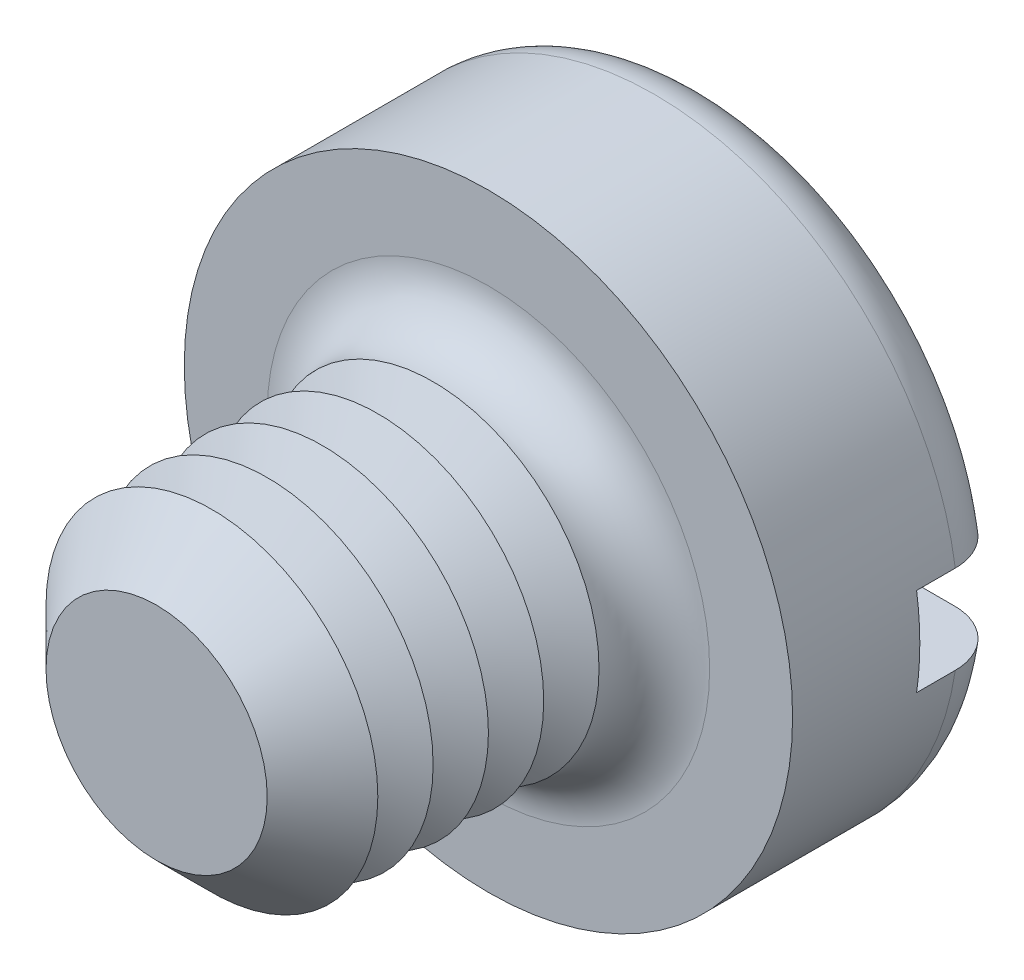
ISO-10303-21;
HEADER;
FILE_DESCRIPTION(('STEP AP214'),'2;1');
FILE_NAME('part.step','',(''),(''),'','','');
FILE_SCHEMA(('AUTOMOTIVE_DESIGN { 1 0 10303 214 1 1 1 1 }'));
ENDSEC;
DATA;
#1=APPLICATION_CONTEXT('core data for automotive mechanical design processes');
#2=APPLICATION_PROTOCOL_DEFINITION('international standard','automotive_design',2000,#1);
#3=PRODUCT_CONTEXT('',#1,'mechanical');
#4=PRODUCT('Part','Part','',(#3));
#5=PRODUCT_RELATED_PRODUCT_CATEGORY('part','',(#4));
#6=PRODUCT_DEFINITION_FORMATION('','',#4);
#7=PRODUCT_DEFINITION_CONTEXT('part definition',#1,'design');
#8=PRODUCT_DEFINITION('design','',#6,#7);
#9=PRODUCT_DEFINITION_SHAPE('','',#8);
#10=(LENGTH_UNIT() NAMED_UNIT(*) SI_UNIT(.MILLI.,.METRE.));
#11=(NAMED_UNIT(*) PLANE_ANGLE_UNIT() SI_UNIT($,.RADIAN.));
#12=(NAMED_UNIT(*) SI_UNIT($,.STERADIAN.) SOLID_ANGLE_UNIT());
#13=UNCERTAINTY_MEASURE_WITH_UNIT(LENGTH_MEASURE(1.E-05),#10,'distance_accuracy_value','');
#14=(GEOMETRIC_REPRESENTATION_CONTEXT(3) GLOBAL_UNCERTAINTY_ASSIGNED_CONTEXT((#13)) GLOBAL_UNIT_ASSIGNED_CONTEXT((#10,
#11,#12)) REPRESENTATION_CONTEXT('',''));
#15=CARTESIAN_POINT('',(0.,0.,0.));
#16=DIRECTION('',(0.,0.,1.));
#17=DIRECTION('',(1.,0.,0.));
#18=AXIS2_PLACEMENT_3D('',#15,#16,#17);
#19=CARTESIAN_POINT('',(0.,0.,-2.));
#20=DIRECTION('',(0.,0.,1.));
#21=DIRECTION('',(1.,0.,0.));
#22=AXIS2_PLACEMENT_3D('',#19,#20,#21);
#23=PLANE('',#22);
#24=CARTESIAN_POINT('',(0.,0.,-2.));
#25=DIRECTION('',(0.,0.,1.));
#26=DIRECTION('',(1.,0.,0.));
#27=AXIS2_PLACEMENT_3D('',#24,#25,#26);
#28=CIRCLE('',#27,2.25);
#29=CARTESIAN_POINT('',(-2.21415898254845,0.4,-2.));
#30=VERTEX_POINT('',#29);
#31=CARTESIAN_POINT('',(2.21415898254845,0.4,-2.));
#32=VERTEX_POINT('',#31);
#33=EDGE_CURVE('E116',#30,#32,#28,.F.);
#34=ORIENTED_EDGE('',*,*,#33,.T.);
#35=DIRECTION('',(1.,0.,0.));
#36=VECTOR('',#35,1.);
#37=CARTESIAN_POINT('',(-2.75,0.4,-2.));
#38=LINE('',#37,#36);
#39=EDGE_CURVE('E111',#30,#32,#38,.T.);
#40=ORIENTED_EDGE('',*,*,#39,.F.);
#41=EDGE_LOOP('',(#34,#40));
#42=FACE_BOUND('',#41,.T.);
#43=ADVANCED_FACE('F39',(#42),#23,.F.);
#44=CARTESIAN_POINT('',(0.,0.,-1.5));
#45=DIRECTION('',(0.,0.,1.));
#46=DIRECTION('',(1.,0.,0.));
#47=AXIS2_PLACEMENT_3D('',#44,#45,#46);
#48=TOROIDAL_SURFACE('',#47,2.25,0.5);
#49=CARTESIAN_POINT('',(-2.6296588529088,0.4,-1.78631483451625));
#50=CARTESIAN_POINT('',(-2.61332846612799,0.4,-1.80942627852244));
#51=CARTESIAN_POINT('',(-2.59501593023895,0.4,-1.83116426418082));
#52=CARTESIAN_POINT('',(-2.55497423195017,0.4,-1.87126271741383));
#53=CARTESIAN_POINT('',(-2.53324055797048,0.4,-1.88961865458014));
#54=CARTESIAN_POINT('',(-2.48702796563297,0.4,-1.92241505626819));
#55=CARTESIAN_POINT('',(-2.46255183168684,0.4,-1.93685944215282));
#56=CARTESIAN_POINT('',(-2.41154731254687,0.4,-1.96147315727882));
#57=CARTESIAN_POINT('',(-2.38501943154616,0.4,-1.97164353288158));
#58=CARTESIAN_POINT('',(-2.3303912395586,0.4,-1.98753780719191));
#59=CARTESIAN_POINT('',(-2.30227842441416,0.4,-1.99321871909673));
#60=CARTESIAN_POINT('',(-2.24549884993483,0.4,-1.99984170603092));
#61=CARTESIAN_POINT('',(-2.21683202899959,0.4,-2.00078325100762));
#62=CARTESIAN_POINT('',(-2.15939326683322,0.4,-1.99790249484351));
#63=CARTESIAN_POINT('',(-2.13062419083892,0.4,-1.99402290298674));
#64=CARTESIAN_POINT('',(-2.07413526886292,0.4,-1.98151915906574));
#65=CARTESIAN_POINT('',(-2.04641547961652,0.4,-1.97289475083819));
#66=CARTESIAN_POINT('',(-1.99264697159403,0.4,-1.95107177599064));
#67=CARTESIAN_POINT('',(-1.96660904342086,0.4,-1.93784659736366));
#68=CARTESIAN_POINT('',(-1.91713954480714,0.4,-1.90718730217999));
#69=CARTESIAN_POINT('',(-1.89370795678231,0.4,-1.88975321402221));
#70=CARTESIAN_POINT('',(-1.85029144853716,0.4,-1.85126548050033));
#71=CARTESIAN_POINT('',(-1.83028607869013,0.4,-1.83023492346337));
#72=CARTESIAN_POINT('',(-1.79417432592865,0.4,-1.78505552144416));
#73=CARTESIAN_POINT('',(-1.77806752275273,0.4,-1.76090701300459));
#74=CARTESIAN_POINT('',(-1.75056079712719,0.4,-1.71067721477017));
#75=CARTESIAN_POINT('',(-1.7390748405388,0.4,-1.68464306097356));
#76=CARTESIAN_POINT('',(-1.72075680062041,0.4,-1.63098625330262));
#77=CARTESIAN_POINT('',(-1.71392397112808,0.4,-1.60336385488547));
#78=CARTESIAN_POINT('',(-1.70525661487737,0.4,-1.54801066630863));
#79=CARTESIAN_POINT('',(-1.70330866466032,0.4,-1.52029759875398));
#80=CARTESIAN_POINT('',(-1.70414820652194,0.4,-1.46494458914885));
#81=CARTESIAN_POINT('',(-1.70693532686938,0.4,-1.43730464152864));
#82=CARTESIAN_POINT('',(-1.71709335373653,0.4,-1.38318389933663));
#83=CARTESIAN_POINT('',(-1.72441580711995,0.4,-1.35669397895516));
#84=CARTESIAN_POINT('',(-1.74335830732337,0.4,-1.30529964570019));
#85=CARTESIAN_POINT('',(-1.75497853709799,0.4,-1.2803953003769));
#86=CARTESIAN_POINT('',(-1.78229453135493,0.4,-1.23258298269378));
#87=CARTESIAN_POINT('',(-1.79803217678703,0.4,-1.20969896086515));
#88=CARTESIAN_POINT('',(-1.83304498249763,0.4,-1.16682064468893));
#89=CARTESIAN_POINT('',(-1.85232054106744,0.4,-1.1468266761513));
#90=CARTESIAN_POINT('',(-1.89433695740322,0.4,-1.10980713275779));
#91=CARTESIAN_POINT('',(-1.91714740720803,0.4,-1.09286053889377));
#92=CARTESIAN_POINT('',(-1.96524407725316,0.4,-1.06294809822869));
#93=CARTESIAN_POINT('',(-1.99053056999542,0.4,-1.04998269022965));
#94=CARTESIAN_POINT('',(-2.04340612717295,0.4,-1.02814800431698));
#95=CARTESIAN_POINT('',(-2.07103098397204,0.4,-1.01936532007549));
#96=CARTESIAN_POINT('',(-2.12735840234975,0.4,-1.00652373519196));
#97=CARTESIAN_POINT('',(-2.15606102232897,0.4,-1.00246509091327));
#98=CARTESIAN_POINT('',(-2.21395379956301,0.4,-0.999181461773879));
#99=CARTESIAN_POINT('',(-2.24314598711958,0.4,-0.999992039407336));
#100=CARTESIAN_POINT('',(-2.30097585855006,0.4,-1.00652779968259));
#101=CARTESIAN_POINT('',(-2.32961355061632,0.4,-1.01225290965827));
#102=CARTESIAN_POINT('',(-2.38536238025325,0.4,-1.02843951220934));
#103=CARTESIAN_POINT('',(-2.41248047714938,0.4,-1.03887701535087));
#104=CARTESIAN_POINT('',(-2.46454860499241,0.4,-1.06421009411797));
#105=CARTESIAN_POINT('',(-2.48949875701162,0.4,-1.0791054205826));
#106=CARTESIAN_POINT('',(-2.53620471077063,0.4,-1.11274531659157));
#107=CARTESIAN_POINT('',(-2.55799482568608,0.4,-1.1314422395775));
#108=CARTESIAN_POINT('',(-2.59807595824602,0.4,-1.17227176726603));
#109=CARTESIAN_POINT('',(-2.6163672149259,0.4,-1.19440413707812));
#110=CARTESIAN_POINT('',(-2.64868581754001,0.4,-1.24117072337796));
#111=CARTESIAN_POINT('',(-2.66276466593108,0.4,-1.26576935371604));
#112=CARTESIAN_POINT('',(-2.68654482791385,0.4,-1.31699754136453));
#113=CARTESIAN_POINT('',(-2.69624657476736,0.4,-1.34362689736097));
#114=CARTESIAN_POINT('',(-2.71090527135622,0.4,-1.39787706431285));
#115=CARTESIAN_POINT('',(-2.71590826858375,0.4,-1.4254854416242));
#116=CARTESIAN_POINT('',(-2.72118463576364,0.4,-1.48115803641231));
#117=CARTESIAN_POINT('',(-2.72145696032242,0.4,-1.50922235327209));
#118=CARTESIAN_POINT('',(-2.71727180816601,0.4,-1.56487271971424));
#119=CARTESIAN_POINT('',(-2.71283440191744,0.4,-1.59246029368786));
#120=CARTESIAN_POINT('',(-2.69939521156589,0.4,-1.64647499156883));
#121=CARTESIAN_POINT('',(-2.69039909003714,0.4,-1.67290351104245));
#122=CARTESIAN_POINT('',(-2.67251693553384,0.4,-1.71382731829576));
#123=CARTESIAN_POINT('',(-2.66497994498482,0.4,-1.72892686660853));
#124=CARTESIAN_POINT('',(-2.64841616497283,0.4,-1.75828509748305));
#125=CARTESIAN_POINT('',(-2.63938938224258,0.4,-1.77254378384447));
#126=CARTESIAN_POINT('',(-2.6296588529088,0.4,-1.78631483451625));
#127=B_SPLINE_CURVE_WITH_KNOTS('',3,(#49,#50,#51,#52,#53,#54,#55,#56,#57,#58,#59,#60,#61,#62,
#63,#64,#65,#66,#67,#68,#69,#70,#71,#72,#73,#74,#75,#76,#77,#78,#79,#80,#81,#82,#83,#84,#85,#86,
#87,#88,#89,#90,#91,#92,#93,#94,#95,#96,#97,#98,#99,#100,#101,#102,#103,#104,#105,#106,#107,
#108,#109,#110,#111,#112,#113,#114,#115,#116,#117,#118,#119,#120,#121,#122,#123,#124,#125,#126),
.UNSPECIFIED.,.T.,.F.,(4,2,2,2,2,2,2,2,2,2,2,2,2,2,2,2,2,2,2,2,2,2,2,2,2,2,2,2,2,2,2,2,2,2,2,2,
2,2,4),(0.,0.0848338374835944,0.16978050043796,0.25464168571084,0.339482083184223,
0.425125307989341,0.510778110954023,0.597458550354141,0.684143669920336,0.771338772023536,
0.85853328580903,0.945187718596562,1.03183280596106,1.11678035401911,1.20171427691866,
1.28465703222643,1.36759327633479,1.4496584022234,1.53172702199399,1.61466526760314,
1.69761285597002,1.78247103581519,1.86733856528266,1.95389396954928,2.0404540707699,
2.12764713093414,2.21483890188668,2.30159172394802,2.38833969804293,2.4740609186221,
2.55977628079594,2.6443962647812,2.72900787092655,2.81278135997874,2.89657336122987,
2.98000971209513,3.06334267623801,3.113891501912,3.16444009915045),.UNSPECIFIED.);
#128=CARTESIAN_POINT('',(-2.72075357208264,0.4,-1.50000000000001));
#129=VERTEX_POINT('',#128);
#130=EDGE_CURVE('E210',#129,#30,#127,.T.);
#131=ORIENTED_EDGE('',*,*,#130,.F.);
#132=CARTESIAN_POINT('',(0.,0.,-1.5));
#133=DIRECTION('',(0.,0.,1.));
#134=DIRECTION('',(1.,0.,0.));
#135=AXIS2_PLACEMENT_3D('',#132,#133,#134);
#136=CIRCLE('',#135,2.75);
#137=CARTESIAN_POINT('',(2.7207535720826,0.4,-1.5));
#138=VERTEX_POINT('',#137);
#139=EDGE_CURVE('E125',#138,#129,#136,.T.);
#140=ORIENTED_EDGE('',*,*,#139,.F.);
#141=CARTESIAN_POINT('',(1.7362507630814,0.4,-1.6752840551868));
#142=CARTESIAN_POINT('',(1.74636083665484,0.4,-1.70159961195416));
#143=CARTESIAN_POINT('',(1.7587429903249,0.4,-1.72706707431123));
#144=CARTESIAN_POINT('',(1.78764414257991,0.4,-1.77556609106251));
#145=CARTESIAN_POINT('',(1.80416918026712,0.4,-1.79859401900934));
#146=CARTESIAN_POINT('',(1.84080454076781,0.4,-1.84153587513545));
#147=CARTESIAN_POINT('',(1.86090949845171,0.4,-1.86145438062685));
#148=CARTESIAN_POINT('',(1.9041208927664,0.4,-1.89769607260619));
#149=CARTESIAN_POINT('',(1.92722659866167,0.4,-1.91402013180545));
#150=CARTESIAN_POINT('',(1.97620958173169,0.4,-1.94291288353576));
#151=CARTESIAN_POINT('',(2.00212726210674,0.4,-1.95541309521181));
#152=CARTESIAN_POINT('',(2.05567603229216,0.4,-1.97595143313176));
#153=CARTESIAN_POINT('',(2.08330733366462,0.4,-1.98398900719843));
#154=CARTESIAN_POINT('',(2.13989163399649,0.4,-1.99545904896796));
#155=CARTESIAN_POINT('',(2.16885726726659,0.4,-1.99882930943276));
#156=CARTESIAN_POINT('',(2.22694412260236,0.4,-2.00065872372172));
#157=CARTESIAN_POINT('',(2.25606534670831,0.4,-1.99911781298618));
#158=CARTESIAN_POINT('',(2.31362436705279,0.4,-1.99114818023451));
#159=CARTESIAN_POINT('',(2.34206235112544,0.4,-1.98472081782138));
#160=CARTESIAN_POINT('',(2.39743709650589,0.4,-1.96713601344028));
#161=CARTESIAN_POINT('',(2.42437392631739,0.4,-1.95597878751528));
#162=CARTESIAN_POINT('',(2.47569769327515,0.4,-1.92935960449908));
#163=CARTESIAN_POINT('',(2.50010686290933,0.4,-1.91394052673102));
#164=CARTESIAN_POINT('',(2.54594525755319,0.4,-1.8791725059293));
#165=CARTESIAN_POINT('',(2.56737468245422,0.4,-1.85982382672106));
#166=CARTESIAN_POINT('',(2.60634898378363,0.4,-1.81801641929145));
#167=CARTESIAN_POINT('',(2.6239407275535,0.4,-1.79560138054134));
#168=CARTESIAN_POINT('',(2.65505953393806,0.4,-1.7481077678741));
#169=CARTESIAN_POINT('',(2.66858686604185,0.4,-1.72302937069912));
#170=CARTESIAN_POINT('',(2.69103536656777,0.4,-1.67123055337));
#171=CARTESIAN_POINT('',(2.70000740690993,0.4,-1.64453217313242));
#172=CARTESIAN_POINT('',(2.71330608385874,0.4,-1.59000262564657));
#173=CARTESIAN_POINT('',(2.71763293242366,0.4,-1.5621715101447));
#174=CARTESIAN_POINT('',(2.72149675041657,0.4,-1.50637655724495));
#175=CARTESIAN_POINT('',(2.72106725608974,0.4,-1.47841503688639));
#176=CARTESIAN_POINT('',(2.7155123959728,0.4,-1.42296287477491));
#177=CARTESIAN_POINT('',(2.71038711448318,0.4,-1.39547222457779));
#178=CARTESIAN_POINT('',(2.69560462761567,0.4,-1.34178071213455));
#179=CARTESIAN_POINT('',(2.68595389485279,0.4,-1.31557806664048));
#180=CARTESIAN_POINT('',(2.66240876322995,0.4,-1.26515516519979));
#181=CARTESIAN_POINT('',(2.64851431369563,0.4,-1.24093493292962));
#182=CARTESIAN_POINT('',(2.61681930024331,0.4,-1.19504594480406));
#183=CARTESIAN_POINT('',(2.59900198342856,0.4,-1.17338876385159));
#184=CARTESIAN_POINT('',(2.56001495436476,0.4,-1.13333899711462));
#185=CARTESIAN_POINT('',(2.53884510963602,0.4,-1.11494654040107));
#186=CARTESIAN_POINT('',(2.49354554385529,0.4,-1.08175888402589));
#187=CARTESIAN_POINT('',(2.46938991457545,0.4,-1.06699905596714));
#188=CARTESIAN_POINT('',(2.41896725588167,0.4,-1.04168682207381));
#189=CARTESIAN_POINT('',(2.39270009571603,0.4,-1.03113467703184));
#190=CARTESIAN_POINT('',(2.33844927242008,0.4,-1.01439607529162));
#191=CARTESIAN_POINT('',(2.31044823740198,0.4,-1.00826592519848));
#192=CARTESIAN_POINT('',(2.2538175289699,0.4,-1.00073183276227));
#193=CARTESIAN_POINT('',(2.22518781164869,0.4,-0.999328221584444));
#194=CARTESIAN_POINT('',(2.16774231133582,0.4,-1.00127811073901));
#195=CARTESIAN_POINT('',(2.13892848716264,0.4,-1.00468955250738));
#196=CARTESIAN_POINT('',(2.08227193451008,0.4,-1.01626887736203));
#197=CARTESIAN_POINT('',(2.05442926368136,0.4,-1.02443704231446));
#198=CARTESIAN_POINT('',(2.00032604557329,0.4,-1.04537295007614));
#199=CARTESIAN_POINT('',(1.97407661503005,0.4,-1.05816944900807));
#200=CARTESIAN_POINT('',(1.92411255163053,0.4,-1.08801035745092));
#201=CARTESIAN_POINT('',(1.90039792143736,0.4,-1.10505477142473));
#202=CARTESIAN_POINT('',(1.85633574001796,0.4,-1.14282887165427));
#203=CARTESIAN_POINT('',(1.83597040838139,0.4,-1.16353779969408));
#204=CARTESIAN_POINT('',(1.79908731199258,0.4,-1.20813793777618));
#205=CARTESIAN_POINT('',(1.78256899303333,0.4,-1.23202868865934));
#206=CARTESIAN_POINT('',(1.75420022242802,0.4,-1.28183173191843));
#207=CARTESIAN_POINT('',(1.74226635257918,0.4,-1.30769648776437));
#208=CARTESIAN_POINT('',(1.72302798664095,0.4,-1.36110211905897));
#209=CARTESIAN_POINT('',(1.71572395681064,0.4,-1.38864316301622));
#210=CARTESIAN_POINT('',(1.70611974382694,0.4,-1.44392326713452));
#211=CARTESIAN_POINT('',(1.70370764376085,0.4,-1.47164298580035));
#212=CARTESIAN_POINT('',(1.70363822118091,0.4,-1.52706336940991));
#213=CARTESIAN_POINT('',(1.70597448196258,0.4,-1.55476400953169));
#214=CARTESIAN_POINT('',(1.71335146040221,0.4,-1.59796127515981));
#215=CARTESIAN_POINT('',(1.71686033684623,0.4,-1.61373520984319));
#216=CARTESIAN_POINT('',(1.7254146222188,0.4,-1.64486018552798));
#217=CARTESIAN_POINT('',(1.73045999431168,0.4,-1.66021123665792));
#218=CARTESIAN_POINT('',(1.7362507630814,0.4,-1.6752840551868));
#219=B_SPLINE_CURVE_WITH_KNOTS('',3,(#141,#142,#143,#144,#145,#146,#147,#148,#149,#150,#151,
#152,#153,#154,#155,#156,#157,#158,#159,#160,#161,#162,#163,#164,#165,#166,#167,#168,#169,#170,
#171,#172,#173,#174,#175,#176,#177,#178,#179,#180,#181,#182,#183,#184,#185,#186,#187,#188,#189,
#190,#191,#192,#193,#194,#195,#196,#197,#198,#199,#200,#201,#202,#203,#204,#205,#206,#207,#208,
#209,#210,#211,#212,#213,#214,#215,#216,#217,#218),.UNSPECIFIED.,.T.,.F.,(4,2,2,2,2,2,2,2,2,2,2,
2,2,2,2,2,2,2,2,2,2,2,2,2,2,2,2,2,2,2,2,2,2,2,2,2,2,2,4),(0.,0.0845117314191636,
0.169147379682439,0.253657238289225,0.338146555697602,0.424070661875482,0.510005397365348,
0.597074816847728,0.684145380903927,0.771191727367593,0.858234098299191,0.944430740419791,
1.03062159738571,1.11569223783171,1.20075723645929,1.28485012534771,1.36893917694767,
1.45243570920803,1.53593074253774,1.61930671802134,1.70268368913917,1.7864238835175,
1.87016738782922,1.95469664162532,2.03923113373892,2.12482389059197,2.21042264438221,
2.29706026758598,2.38370302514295,2.47089361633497,2.55808429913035,2.64479602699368,
2.73149525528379,2.81653234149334,2.9015779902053,2.98465497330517,3.06761976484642,
3.11602689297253,3.164432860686),.UNSPECIFIED.);
#220=EDGE_CURVE('E212',#32,#138,#219,.T.);
#221=ORIENTED_EDGE('',*,*,#220,.F.);
#222=ORIENTED_EDGE('',*,*,#33,.F.);
#223=EDGE_LOOP('',(#131,#140,#221,#222));
#224=FACE_BOUND('',#223,.T.);
#225=ADVANCED_FACE('F194',(#224),#48,.T.);
#226=CARTESIAN_POINT('',(0.,0.,-2.));
#227=DIRECTION('',(0.,0.,1.));
#228=DIRECTION('',(1.,0.,0.));
#229=AXIS2_PLACEMENT_3D('',#226,#227,#228);
#230=CYLINDRICAL_SURFACE('',#229,2.75);
#231=DIRECTION('',(0.,0.,1.));
#232=VECTOR('',#231,1.);
#233=CARTESIAN_POINT('',(2.72075357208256,0.4,-2.));
#234=LINE('',#233,#232);
#235=CARTESIAN_POINT('',(2.72075357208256,0.4,-1.15));
#236=VERTEX_POINT('',#235);
#237=EDGE_CURVE('E224',#138,#236,#234,.T.);
#238=ORIENTED_EDGE('',*,*,#237,.F.);
#239=ORIENTED_EDGE('',*,*,#139,.T.);
#240=DIRECTION('',(0.,0.,1.));
#241=VECTOR('',#240,1.);
#242=CARTESIAN_POINT('',(-2.72075357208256,0.4,-2.));
#243=LINE('',#242,#241);
#244=CARTESIAN_POINT('',(-2.72075357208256,0.4,-1.15));
#245=VERTEX_POINT('',#244);
#246=EDGE_CURVE('E63',#245,#129,#243,.F.);
#247=ORIENTED_EDGE('',*,*,#246,.F.);
#248=CARTESIAN_POINT('',(0.,0.,-1.15));
#249=DIRECTION('',(0.,0.,-1.));
#250=DIRECTION('',(-1.,0.,0.));
#251=AXIS2_PLACEMENT_3D('',#248,#249,#250);
#252=CIRCLE('',#251,2.75);
#253=CARTESIAN_POINT('',(-2.72075357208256,-0.4,-1.15));
#254=VERTEX_POINT('',#253);
#255=EDGE_CURVE('E43',#245,#254,#252,.F.);
#256=ORIENTED_EDGE('',*,*,#255,.T.);
#257=DIRECTION('',(0.,0.,1.));
#258=VECTOR('',#257,1.);
#259=CARTESIAN_POINT('',(-2.72075357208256,-0.4,-2.));
#260=LINE('',#259,#258);
#261=CARTESIAN_POINT('',(-2.72075357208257,-0.4,-1.5));
#262=VERTEX_POINT('',#261);
#263=EDGE_CURVE('E221',#262,#254,#260,.T.);
#264=ORIENTED_EDGE('',*,*,#263,.F.);
#265=CARTESIAN_POINT('',(2.72075357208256,-0.4,-1.5));
#266=VERTEX_POINT('',#265);
#267=EDGE_CURVE('E127',#262,#266,#136,.T.);
#268=ORIENTED_EDGE('',*,*,#267,.T.);
#269=DIRECTION('',(0.,0.,1.));
#270=VECTOR('',#269,1.);
#271=CARTESIAN_POINT('',(2.72075357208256,-0.4,-2.));
#272=LINE('',#271,#270);
#273=CARTESIAN_POINT('',(2.72075357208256,-0.4,-1.15));
#274=VERTEX_POINT('',#273);
#275=EDGE_CURVE('E55',#274,#266,#272,.F.);
#276=ORIENTED_EDGE('',*,*,#275,.F.);
#277=EDGE_CURVE('E11',#274,#236,#252,.F.);
#278=ORIENTED_EDGE('',*,*,#277,.T.);
#279=EDGE_LOOP('',(#238,#239,#247,#256,#264,#268,#276,#278));
#280=FACE_BOUND('',#279,.T.);
#281=CARTESIAN_POINT('',(0.,0.,0.));
#282=DIRECTION('',(0.,0.,1.));
#283=DIRECTION('',(1.,0.,0.));
#284=AXIS2_PLACEMENT_3D('',#281,#282,#283);
#285=CIRCLE('',#284,2.75);
#286=CARTESIAN_POINT('',(2.75,0.,0.));
#287=VERTEX_POINT('',#286);
#288=EDGE_CURVE('E227',#287,#287,#285,.T.);
#289=ORIENTED_EDGE('',*,*,#288,.F.);
#290=EDGE_LOOP('',(#289));
#291=FACE_BOUND('',#290,.T.);
#292=ADVANCED_FACE('F190',(#280,#291),#230,.T.);
#293=CARTESIAN_POINT('',(2.21415898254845,-0.4,-2.));
#294=VERTEX_POINT('',#293);
#295=CARTESIAN_POINT('',(-2.21415898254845,-0.4,-2.));
#296=VERTEX_POINT('',#295);
#297=EDGE_CURVE('E109',#294,#296,#28,.F.);
#298=ORIENTED_EDGE('',*,*,#297,.T.);
#299=DIRECTION('',(-1.,0.,0.));
#300=VECTOR('',#299,1.);
#301=CARTESIAN_POINT('',(-2.75,-0.4,-2.));
#302=LINE('',#301,#300);
#303=EDGE_CURVE('E96',#294,#296,#302,.T.);
#304=ORIENTED_EDGE('',*,*,#303,.F.);
#305=EDGE_LOOP('',(#298,#304));
#306=FACE_BOUND('',#305,.T.);
#307=ADVANCED_FACE('F108',(#306),#23,.F.);
#308=CARTESIAN_POINT('',(0.,0.,0.));
#309=DIRECTION('',(0.,0.,1.));
#310=DIRECTION('',(1.,0.,0.));
#311=AXIS2_PLACEMENT_3D('',#308,#309,#310);
#312=PLANE('',#311);
#313=CARTESIAN_POINT('',(0.,0.,0.));
#314=DIRECTION('',(0.,0.,1.));
#315=DIRECTION('',(1.,0.,0.));
#316=AXIS2_PLACEMENT_3D('',#313,#314,#315);
#317=CIRCLE('',#316,2.);
#318=CARTESIAN_POINT('',(2.,0.,0.));
#319=VERTEX_POINT('',#318);
#320=EDGE_CURVE('E115',#319,#319,#317,.F.);
#321=ORIENTED_EDGE('',*,*,#320,.T.);
#322=EDGE_LOOP('',(#321));
#323=FACE_BOUND('',#322,.T.);
#324=ORIENTED_EDGE('',*,*,#288,.T.);
#325=EDGE_LOOP('',(#324));
#326=FACE_BOUND('',#325,.T.);
#327=ADVANCED_FACE('F189',(#323,#326),#312,.T.);
#328=CARTESIAN_POINT('',(-2.6296588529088,-0.4,-1.78631483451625));
#329=CARTESIAN_POINT('',(-2.64575286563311,-0.4,-1.76353353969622));
#330=CARTESIAN_POINT('',(-2.65994473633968,-0.4,-1.73938506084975));
#331=CARTESIAN_POINT('',(-2.68408879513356,-0.4,-1.68903091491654));
#332=CARTESIAN_POINT('',(-2.69403633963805,-0.4,-1.6628230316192));
#333=CARTESIAN_POINT('',(-2.70937899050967,-0.4,-1.60911025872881));
#334=CARTESIAN_POINT('',(-2.71477511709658,-0.4,-1.5816056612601));
#335=CARTESIAN_POINT('',(-2.72085365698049,-0.4,-1.52608718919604));
#336=CARTESIAN_POINT('',(-2.7215371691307,-0.4,-1.49807343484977));
#337=CARTESIAN_POINT('',(-2.71817903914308,-0.4,-1.44242333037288));
#338=CARTESIAN_POINT('',(-2.71415291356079,-0.4,-1.41478604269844));
#339=CARTESIAN_POINT('',(-2.70152104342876,-0.4,-1.36057835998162));
#340=CARTESIAN_POINT('',(-2.69291517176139,-0.4,-1.33400799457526));
#341=CARTESIAN_POINT('',(-2.67137052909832,-0.4,-1.28266198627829));
#342=CARTESIAN_POINT('',(-2.65842829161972,-0.4,-1.25788779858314));
#343=CARTESIAN_POINT('',(-2.62859348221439,-0.4,-1.21084577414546));
#344=CARTESIAN_POINT('',(-2.61170082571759,-0.4,-1.18857799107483));
#345=CARTESIAN_POINT('',(-2.5743351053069,-0.4,-1.1470221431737));
#346=CARTESIAN_POINT('',(-2.55383974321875,-0.4,-1.12775413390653));
#347=CARTESIAN_POINT('',(-2.5099353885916,-0.4,-1.09288845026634));
#348=CARTESIAN_POINT('',(-2.48652625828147,-0.4,-1.07729094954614));
#349=CARTESIAN_POINT('',(-2.43718903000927,-0.4,-1.0500239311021));
#350=CARTESIAN_POINT('',(-2.41123629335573,-0.4,-1.0383990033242));
#351=CARTESIAN_POINT('',(-2.35776417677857,-0.4,-1.01960886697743));
#352=CARTESIAN_POINT('',(-2.33024469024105,-0.4,-1.01244396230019));
#353=CARTESIAN_POINT('',(-2.27404134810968,-0.4,-1.00268156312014));
#354=CARTESIAN_POINT('',(-2.24534705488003,-0.4,-1.00014414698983));
#355=CARTESIAN_POINT('',(-2.18793513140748,-0.4,-0.999867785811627));
#356=CARTESIAN_POINT('',(-2.15921749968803,-0.4,-1.00212917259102));
#357=CARTESIAN_POINT('',(-2.10225052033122,-0.4,-1.01142552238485));
#358=CARTESIAN_POINT('',(-2.07400941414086,-0.4,-1.01851105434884));
#359=CARTESIAN_POINT('',(-2.01911044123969,-0.4,-1.03730994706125));
#360=CARTESIAN_POINT('',(-1.99245264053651,-0.4,-1.04902350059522));
#361=CARTESIAN_POINT('',(-1.94142108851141,-0.4,-1.07679847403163));
#362=CARTESIAN_POINT('',(-1.91705303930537,-0.4,-1.09287038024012));
#363=CARTESIAN_POINT('',(-1.87139758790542,-0.4,-1.12891897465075));
#364=CARTESIAN_POINT('',(-1.85011007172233,-0.4,-1.148895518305));
#365=CARTESIAN_POINT('',(-1.81149058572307,-0.4,-1.19196940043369));
#366=CARTESIAN_POINT('',(-1.79411779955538,-0.4,-1.21503011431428));
#367=CARTESIAN_POINT('',(-1.76359546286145,-0.4,-1.26379588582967));
#368=CARTESIAN_POINT('',(-1.75044532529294,-0.4,-1.28950057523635));
#369=CARTESIAN_POINT('',(-1.72906221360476,-0.4,-1.3422057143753));
#370=CARTESIAN_POINT('',(-1.72072512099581,-0.4,-1.3691639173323));
#371=CARTESIAN_POINT('',(-1.70880448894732,-0.4,-1.42411084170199));
#372=CARTESIAN_POINT('',(-1.7052202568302,-0.4,-1.45209941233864));
#373=CARTESIAN_POINT('',(-1.70295553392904,-0.4,-1.50768522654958));
#374=CARTESIAN_POINT('',(-1.70417398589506,-0.4,-1.53527840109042));
#375=CARTESIAN_POINT('',(-1.71124536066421,-0.4,-1.58986292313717));
#376=CARTESIAN_POINT('',(-1.71709811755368,-0.4,-1.61685429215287));
#377=CARTESIAN_POINT('',(-1.73321132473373,-0.4,-1.66938107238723));
#378=CARTESIAN_POINT('',(-1.74345625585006,-0.4,-1.69492125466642));
#379=CARTESIAN_POINT('',(-1.76802111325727,-0.4,-1.74395877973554));
#380=CARTESIAN_POINT('',(-1.78234133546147,-0.4,-1.76745597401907));
#381=CARTESIAN_POINT('',(-1.81488631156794,-0.4,-1.81216193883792));
#382=CARTESIAN_POINT('',(-1.83317116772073,-0.4,-1.83332693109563));
#383=CARTESIAN_POINT('',(-1.87296030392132,-0.4,-1.872375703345));
#384=CARTESIAN_POINT('',(-1.89446497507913,-0.4,-1.89025908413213));
#385=CARTESIAN_POINT('',(-1.94063077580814,-0.4,-1.92267732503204));
#386=CARTESIAN_POINT('',(-1.96535444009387,-0.4,-1.93712316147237));
#387=CARTESIAN_POINT('',(-2.01684705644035,-0.4,-1.96173690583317));
#388=CARTESIAN_POINT('',(-2.04361620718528,-0.4,-1.97190439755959));
#389=CARTESIAN_POINT('',(-2.09891021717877,-0.4,-1.9878230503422));
#390=CARTESIAN_POINT('',(-2.12745653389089,-0.4,-1.99349978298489));
#391=CARTESIAN_POINT('',(-2.18509639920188,-0.4,-1.99999556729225));
#392=CARTESIAN_POINT('',(-2.21418994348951,-0.4,-2.00081465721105));
#393=CARTESIAN_POINT('',(-2.27218032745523,-0.4,-1.99755156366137));
#394=CARTESIAN_POINT('',(-2.30107643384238,-0.4,-1.99345627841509));
#395=CARTESIAN_POINT('',(-2.35776697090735,-0.4,-1.98043125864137));
#396=CARTESIAN_POINT('',(-2.38556116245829,-0.4,-1.97150048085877));
#397=CARTESIAN_POINT('',(-2.43901832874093,-0.4,-1.94912081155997));
#398=CARTESIAN_POINT('',(-2.46469578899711,-0.4,-1.93570648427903));
#399=CARTESIAN_POINT('',(-2.51337022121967,-0.4,-1.90471183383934));
#400=CARTESIAN_POINT('',(-2.53637056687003,-0.4,-1.88713684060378));
#401=CARTESIAN_POINT('',(-2.57111030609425,-0.4,-1.85552084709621));
#402=CARTESIAN_POINT('',(-2.58386709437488,-0.4,-1.84257896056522));
#403=CARTESIAN_POINT('',(-2.60790410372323,-0.4,-1.81538935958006));
#404=CARTESIAN_POINT('',(-2.61918433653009,-0.4,-1.80114165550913));
#405=CARTESIAN_POINT('',(-2.6296588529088,-0.4,-1.78631483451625));
#406=B_SPLINE_CURVE_WITH_KNOTS('',3,(#328,#329,#330,#331,#332,#333,#334,#335,#336,#337,#338,
#339,#340,#341,#342,#343,#344,#345,#346,#347,#348,#349,#350,#351,#352,#353,#354,#355,#356,#357,
#358,#359,#360,#361,#362,#363,#364,#365,#366,#367,#368,#369,#370,#371,#372,#373,#374,#375,#376,
#377,#378,#379,#380,#381,#382,#383,#384,#385,#386,#387,#388,#389,#390,#391,#392,#393,#394,#395,
#396,#397,#398,#399,#400,#401,#402,#403,#404,#405),.UNSPECIFIED.,.T.,.F.,(4,2,2,2,2,2,2,2,2,2,2,
2,2,2,2,2,2,2,2,2,2,2,2,2,2,2,2,2,2,2,2,2,2,2,2,2,2,2,4),(0.,0.0836125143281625,
0.167316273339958,0.251001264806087,0.334666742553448,0.418057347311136,0.501450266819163,
0.584910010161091,0.668371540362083,0.752369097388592,0.836370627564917,0.921286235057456,
1.00620762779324,1.09222390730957,1.17824613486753,1.26518425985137,1.35212600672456,
1.43927882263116,1.52642841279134,1.61262232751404,1.69880425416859,1.7830443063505,
1.86727208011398,1.9497371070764,2.03219918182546,2.1143722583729,2.19655130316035,
2.28007615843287,2.36361116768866,2.44911836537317,2.53463387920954,2.62153862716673,
2.70844269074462,2.79557895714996,2.88273403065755,2.96923214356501,3.05562004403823,
3.11003826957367,3.16445606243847),.UNSPECIFIED.);
#407=EDGE_CURVE('E103',#296,#262,#406,.T.);
#408=ORIENTED_EDGE('',*,*,#407,.F.);
#409=ORIENTED_EDGE('',*,*,#297,.F.);
#410=CARTESIAN_POINT('',(1.7362507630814,-0.4,-1.6752840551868));
#411=CARTESIAN_POINT('',(1.72641416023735,-0.4,-1.64967314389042));
#412=CARTESIAN_POINT('',(1.71871480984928,-0.4,-1.62322216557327));
#413=CARTESIAN_POINT('',(1.70786038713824,-0.4,-1.56938399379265));
#414=CARTESIAN_POINT('',(1.70470970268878,-0.4,-1.54199592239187));
#415=CARTESIAN_POINT('',(1.70306971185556,-0.4,-1.48708393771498));
#416=CARTESIAN_POINT('',(1.70457942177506,-0.4,-1.45956005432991));
#417=CARTESIAN_POINT('',(1.71220670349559,-0.4,-1.40516538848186));
#418=CARTESIAN_POINT('',(1.71832341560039,-0.4,-1.3782944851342));
#419=CARTESIAN_POINT('',(1.73494792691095,-0.4,-1.32598312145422));
#420=CARTESIAN_POINT('',(1.74545076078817,-0.4,-1.30054108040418));
#421=CARTESIAN_POINT('',(1.77051013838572,-0.4,-1.25173932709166));
#422=CARTESIAN_POINT('',(1.7850670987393,-0.4,-1.22837982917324));
#423=CARTESIAN_POINT('',(1.81806903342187,-0.4,-1.1839775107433));
#424=CARTESIAN_POINT('',(1.8365752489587,-0.4,-1.16298023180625));
#425=CARTESIAN_POINT('',(1.87677669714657,-0.4,-1.1243010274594));
#426=CARTESIAN_POINT('',(1.89847230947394,-0.4,-1.10661949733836));
#427=CARTESIAN_POINT('',(1.94498854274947,-0.4,-1.07463966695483));
#428=CARTESIAN_POINT('',(1.96987078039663,-0.4,-1.06043095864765));
#429=CARTESIAN_POINT('',(2.02163980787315,-0.4,-1.0363161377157));
#430=CARTESIAN_POINT('',(2.04852678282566,-0.4,-1.02641042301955));
#431=CARTESIAN_POINT('',(2.10400319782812,-0.4,-1.01104128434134));
#432=CARTESIAN_POINT('',(2.13261287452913,-0.4,-1.00565079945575));
#433=CARTESIAN_POINT('',(2.19033179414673,-0.4,-0.999735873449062));
#434=CARTESIAN_POINT('',(2.2194410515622,-0.4,-0.999211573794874));
#435=CARTESIAN_POINT('',(2.27740442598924,-0.4,-1.00306591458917));
#436=CARTESIAN_POINT('',(2.30625777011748,-0.4,-1.00745623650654));
#437=CARTESIAN_POINT('',(2.36280530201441,-0.4,-1.02105937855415));
#438=CARTESIAN_POINT('',(2.39049952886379,-0.4,-1.03027203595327));
#439=CARTESIAN_POINT('',(2.44369359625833,-0.4,-1.05318710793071));
#440=CARTESIAN_POINT('',(2.46920965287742,-0.4,-1.0668518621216));
#441=CARTESIAN_POINT('',(2.51754507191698,-0.4,-1.09832423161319));
#442=CARTESIAN_POINT('',(2.54036461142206,-0.4,-1.11613157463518));
#443=CARTESIAN_POINT('',(2.58234752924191,-0.4,-1.15513986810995));
#444=CARTESIAN_POINT('',(2.601553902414,-0.4,-1.1762945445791));
#445=CARTESIAN_POINT('',(2.63609001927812,-0.4,-1.22156192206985));
#446=CARTESIAN_POINT('',(2.65142002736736,-0.4,-1.24567442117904));
#447=CARTESIAN_POINT('',(2.67757733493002,-0.4,-1.29585881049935));
#448=CARTESIAN_POINT('',(2.68845668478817,-0.4,-1.32190357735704));
#449=CARTESIAN_POINT('',(2.7056478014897,-0.4,-1.375459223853));
#450=CARTESIAN_POINT('',(2.71195980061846,-0.4,-1.40297002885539));
#451=CARTESIAN_POINT('',(2.71979288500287,-0.4,-1.45843707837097));
#452=CARTESIAN_POINT('',(2.72135241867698,-0.4,-1.48638789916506));
#453=CARTESIAN_POINT('',(2.71974298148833,-0.4,-1.54215266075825));
#454=CARTESIAN_POINT('',(2.71657412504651,-0.4,-1.56996660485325));
#455=CARTESIAN_POINT('',(2.70561779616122,-0.4,-1.62459191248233));
#456=CARTESIAN_POINT('',(2.69784258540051,-0.4,-1.65140573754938));
#457=CARTESIAN_POINT('',(2.6779146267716,-0.4,-1.70335337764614));
#458=CARTESIAN_POINT('',(2.66576185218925,-0.4,-1.72848718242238));
#459=CARTESIAN_POINT('',(2.63739107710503,-0.4,-1.77645196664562));
#460=CARTESIAN_POINT('',(2.62116029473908,-0.4,-1.79927538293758));
#461=CARTESIAN_POINT('',(2.58512700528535,-0.4,-1.84190182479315));
#462=CARTESIAN_POINT('',(2.56532438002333,-0.4,-1.86170475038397));
#463=CARTESIAN_POINT('',(2.522535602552,-0.4,-1.89791219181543));
#464=CARTESIAN_POINT('',(2.49952399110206,-0.4,-1.91428661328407));
#465=CARTESIAN_POINT('',(2.45110500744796,-0.4,-1.94299324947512));
#466=CARTESIAN_POINT('',(2.4256974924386,-0.4,-1.95532522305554));
#467=CARTESIAN_POINT('',(2.37288090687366,-0.4,-1.97575769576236));
#468=CARTESIAN_POINT('',(2.34545135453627,-0.4,-1.98380524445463));
#469=CARTESIAN_POINT('',(2.28963821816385,-0.4,-1.99524443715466));
#470=CARTESIAN_POINT('',(2.26125456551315,-0.4,-1.99863574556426));
#471=CARTESIAN_POINT('',(2.20395671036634,-0.4,-2.00070487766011));
#472=CARTESIAN_POINT('',(2.17504033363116,-0.4,-1.99932265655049));
#473=CARTESIAN_POINT('',(2.11784130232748,-0.4,-1.9917648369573));
#474=CARTESIAN_POINT('',(2.08955866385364,-0.4,-1.98558911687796));
#475=CARTESIAN_POINT('',(2.03419451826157,-0.4,-1.96854979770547));
#476=CARTESIAN_POINT('',(2.00712437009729,-0.4,-1.95764925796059));
#477=CARTESIAN_POINT('',(1.95519572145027,-0.4,-1.93144413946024));
#478=CARTESIAN_POINT('',(1.93033780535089,-0.4,-1.91613840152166));
#479=CARTESIAN_POINT('',(1.88362525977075,-0.4,-1.88157419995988));
#480=CARTESIAN_POINT('',(1.86176428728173,-0.4,-1.86232430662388));
#481=CARTESIAN_POINT('',(1.82167218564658,-0.4,-1.82038600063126));
#482=CARTESIAN_POINT('',(1.803436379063,-0.4,-1.7977020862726));
#483=CARTESIAN_POINT('',(1.77700088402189,-0.4,-1.7582526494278));
#484=CARTESIAN_POINT('',(1.7675549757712,-0.4,-1.74230781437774));
#485=CARTESIAN_POINT('',(1.75049861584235,-0.4,-1.70946415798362));
#486=CARTESIAN_POINT('',(1.7428881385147,-0.4,-1.69256534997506));
#487=CARTESIAN_POINT('',(1.7362507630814,-0.4,-1.6752840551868));
#488=B_SPLINE_CURVE_WITH_KNOTS('',3,(#410,#411,#412,#413,#414,#415,#416,#417,#418,#419,#420,
#421,#422,#423,#424,#425,#426,#427,#428,#429,#430,#431,#432,#433,#434,#435,#436,#437,#438,#439,
#440,#441,#442,#443,#444,#445,#446,#447,#448,#449,#450,#451,#452,#453,#454,#455,#456,#457,#458,
#459,#460,#461,#462,#463,#464,#465,#466,#467,#468,#469,#470,#471,#472,#473,#474,#475,#476,#477,
#478,#479,#480,#481,#482,#483,#484,#485,#486,#487),.UNSPECIFIED.,.T.,.F.,(4,2,2,2,2,2,2,2,2,2,2,
2,2,2,2,2,2,2,2,2,2,2,2,2,2,2,2,2,2,2,2,2,2,2,2,2,2,2,4),(0.,0.0822382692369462,
0.164555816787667,0.246855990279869,0.329140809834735,0.411332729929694,0.493533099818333,
0.577115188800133,0.660707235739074,0.746270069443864,0.831840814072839,0.918768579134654,
1.00569887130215,1.09283622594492,1.17997064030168,1.26638632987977,1.35279634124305,
1.43810213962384,1.52340211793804,1.60767384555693,1.69194128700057,1.77552515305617,
1.85910699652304,1.94246734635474,2.02582820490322,2.10945367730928,2.19308191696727,
2.2774160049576,2.36175512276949,2.4471137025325,2.53247843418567,2.61892083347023,
2.70536542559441,2.79249842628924,2.87965437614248,2.96662291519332,3.05347850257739,
3.10897061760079,3.16446195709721),.UNSPECIFIED.);
#489=EDGE_CURVE('E92',#266,#294,#488,.T.);
#490=ORIENTED_EDGE('',*,*,#489,.F.);
#491=ORIENTED_EDGE('',*,*,#267,.F.);
#492=EDGE_LOOP('',(#408,#409,#490,#491));
#493=FACE_BOUND('',#492,.T.);
#494=ADVANCED_FACE('F113',(#493),#48,.T.);
#495=CARTESIAN_POINT('',(0.,0.,0.5));
#496=DIRECTION('',(0.,0.,1.));
#497=DIRECTION('',(1.,0.,0.));
#498=AXIS2_PLACEMENT_3D('',#495,#496,#497);
#499=TOROIDAL_SURFACE('',#498,2.,0.5);
#500=ORIENTED_EDGE('',*,*,#320,.F.);
#501=EDGE_LOOP('',(#500));
#502=FACE_BOUND('',#501,.T.);
#503=CARTESIAN_POINT('',(0.,0.,0.5));
#504=DIRECTION('',(0.,0.,-1.));
#505=DIRECTION('',(-1.,0.,0.));
#506=AXIS2_PLACEMENT_3D('',#503,#504,#505);
#507=CIRCLE('',#506,1.5);
#508=CARTESIAN_POINT('',(-1.5,0.,0.5));
#509=VERTEX_POINT('',#508);
#510=EDGE_CURVE('E233',#509,#509,#507,.T.);
#511=ORIENTED_EDGE('',*,*,#510,.T.);
#512=EDGE_LOOP('',(#511));
#513=FACE_BOUND('',#512,.T.);
#514=ADVANCED_FACE('F182',(#502,#513),#499,.F.);
#515=CARTESIAN_POINT('',(0.,0.,0.75));
#516=DIRECTION('',(0.,0.,-1.));
#517=DIRECTION('',(-1.,0.,0.));
#518=AXIS2_PLACEMENT_3D('',#515,#516,#517);
#519=CONICAL_SURFACE('',#518,1.06698729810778,1.0471975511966);
#520=ORIENTED_EDGE('',*,*,#510,.F.);
#521=EDGE_LOOP('',(#520));
#522=FACE_BOUND('',#521,.T.);
#523=CARTESIAN_POINT('',(0.,0.,0.75));
#524=DIRECTION('',(0.,0.,-1.));
#525=DIRECTION('',(-1.,0.,0.));
#526=AXIS2_PLACEMENT_3D('',#523,#524,#525);
#527=CIRCLE('',#526,1.06698729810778);
#528=CARTESIAN_POINT('',(-1.06698729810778,0.,0.75));
#529=VERTEX_POINT('',#528);
#530=EDGE_CURVE('E239',#529,#529,#527,.T.);
#531=ORIENTED_EDGE('',*,*,#530,.T.);
#532=EDGE_LOOP('',(#531));
#533=FACE_BOUND('',#532,.T.);
#534=ADVANCED_FACE('F178',(#522,#533),#519,.T.);
#535=CARTESIAN_POINT('',(0.,0.,1.));
#536=DIRECTION('',(0.,0.,1.));
#537=DIRECTION('',(1.,0.,0.));
#538=AXIS2_PLACEMENT_3D('',#535,#536,#537);
#539=CONICAL_SURFACE('',#538,1.5,1.0471975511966);
#540=ORIENTED_EDGE('',*,*,#530,.F.);
#541=EDGE_LOOP('',(#540));
#542=FACE_BOUND('',#541,.T.);
#543=CARTESIAN_POINT('',(0.,0.,1.));
#544=DIRECTION('',(0.,0.,-1.));
#545=DIRECTION('',(-1.,0.,0.));
#546=AXIS2_PLACEMENT_3D('',#543,#544,#545);
#547=CIRCLE('',#546,1.5);
#548=CARTESIAN_POINT('',(-1.5,0.,1.));
#549=VERTEX_POINT('',#548);
#550=EDGE_CURVE('E245',#549,#549,#547,.T.);
#551=ORIENTED_EDGE('',*,*,#550,.T.);
#552=EDGE_LOOP('',(#551));
#553=FACE_BOUND('',#552,.T.);
#554=ADVANCED_FACE('F174',(#542,#553),#539,.T.);
#555=CARTESIAN_POINT('',(0.,0.,1.25));
#556=DIRECTION('',(0.,0.,-1.));
#557=DIRECTION('',(-1.,0.,0.));
#558=AXIS2_PLACEMENT_3D('',#555,#556,#557);
#559=CONICAL_SURFACE('',#558,1.06698729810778,1.0471975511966);
#560=ORIENTED_EDGE('',*,*,#550,.F.);
#561=EDGE_LOOP('',(#560));
#562=FACE_BOUND('',#561,.T.);
#563=CARTESIAN_POINT('',(0.,0.,1.25));
#564=DIRECTION('',(0.,0.,-1.));
#565=DIRECTION('',(-1.,0.,0.));
#566=AXIS2_PLACEMENT_3D('',#563,#564,#565);
#567=CIRCLE('',#566,1.06698729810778);
#568=CARTESIAN_POINT('',(-1.06698729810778,0.,1.25));
#569=VERTEX_POINT('',#568);
#570=EDGE_CURVE('E249',#569,#569,#567,.T.);
#571=ORIENTED_EDGE('',*,*,#570,.T.);
#572=EDGE_LOOP('',(#571));
#573=FACE_BOUND('',#572,.T.);
#574=ADVANCED_FACE('F170',(#562,#573),#559,.T.);
#575=CARTESIAN_POINT('',(0.,0.,1.5));
#576=DIRECTION('',(0.,0.,1.));
#577=DIRECTION('',(1.,0.,0.));
#578=AXIS2_PLACEMENT_3D('',#575,#576,#577);
#579=CONICAL_SURFACE('',#578,1.5,1.0471975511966);
#580=ORIENTED_EDGE('',*,*,#570,.F.);
#581=EDGE_LOOP('',(#580));
#582=FACE_BOUND('',#581,.T.);
#583=CARTESIAN_POINT('',(0.,0.,1.5));
#584=DIRECTION('',(0.,0.,-1.));
#585=DIRECTION('',(-1.,0.,0.));
#586=AXIS2_PLACEMENT_3D('',#583,#584,#585);
#587=CIRCLE('',#586,1.5);
#588=CARTESIAN_POINT('',(-1.5,0.,1.5));
#589=VERTEX_POINT('',#588);
#590=EDGE_CURVE('E253',#589,#589,#587,.T.);
#591=ORIENTED_EDGE('',*,*,#590,.T.);
#592=EDGE_LOOP('',(#591));
#593=FACE_BOUND('',#592,.T.);
#594=ADVANCED_FACE('F166',(#582,#593),#579,.T.);
#595=CARTESIAN_POINT('',(0.,0.,1.75));
#596=DIRECTION('',(0.,0.,-1.));
#597=DIRECTION('',(-1.,0.,0.));
#598=AXIS2_PLACEMENT_3D('',#595,#596,#597);
#599=CONICAL_SURFACE('',#598,1.06698729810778,1.0471975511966);
#600=ORIENTED_EDGE('',*,*,#590,.F.);
#601=EDGE_LOOP('',(#600));
#602=FACE_BOUND('',#601,.T.);
#603=CARTESIAN_POINT('',(0.,0.,1.75));
#604=DIRECTION('',(0.,0.,-1.));
#605=DIRECTION('',(-1.,0.,0.));
#606=AXIS2_PLACEMENT_3D('',#603,#604,#605);
#607=CIRCLE('',#606,1.06698729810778);
#608=CARTESIAN_POINT('',(-1.06698729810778,0.,1.75));
#609=VERTEX_POINT('',#608);
#610=EDGE_CURVE('E257',#609,#609,#607,.T.);
#611=ORIENTED_EDGE('',*,*,#610,.T.);
#612=EDGE_LOOP('',(#611));
#613=FACE_BOUND('',#612,.T.);
#614=ADVANCED_FACE('F162',(#602,#613),#599,.T.);
#615=CARTESIAN_POINT('',(0.,0.,2.));
#616=DIRECTION('',(0.,0.,1.));
#617=DIRECTION('',(1.,0.,0.));
#618=AXIS2_PLACEMENT_3D('',#615,#616,#617);
#619=CONICAL_SURFACE('',#618,1.5,1.0471975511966);
#620=ORIENTED_EDGE('',*,*,#610,.F.);
#621=EDGE_LOOP('',(#620));
#622=FACE_BOUND('',#621,.T.);
#623=CARTESIAN_POINT('',(0.,0.,2.));
#624=DIRECTION('',(0.,0.,-1.));
#625=DIRECTION('',(-1.,0.,0.));
#626=AXIS2_PLACEMENT_3D('',#623,#624,#625);
#627=CIRCLE('',#626,1.5);
#628=CARTESIAN_POINT('',(-1.5,0.,2.));
#629=VERTEX_POINT('',#628);
#630=EDGE_CURVE('E260',#629,#629,#627,.T.);
#631=ORIENTED_EDGE('',*,*,#630,.T.);
#632=EDGE_LOOP('',(#631));
#633=FACE_BOUND('',#632,.T.);
#634=ADVANCED_FACE('F158',(#622,#633),#619,.T.);
#635=CARTESIAN_POINT('',(0.,0.,2.25));
#636=DIRECTION('',(0.,0.,-1.));
#637=DIRECTION('',(-1.,0.,0.));
#638=AXIS2_PLACEMENT_3D('',#635,#636,#637);
#639=CONICAL_SURFACE('',#638,1.06698729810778,1.0471975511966);
#640=ORIENTED_EDGE('',*,*,#630,.F.);
#641=EDGE_LOOP('',(#640));
#642=FACE_BOUND('',#641,.T.);
#643=CARTESIAN_POINT('',(0.,0.,2.25));
#644=DIRECTION('',(0.,0.,-1.));
#645=DIRECTION('',(-1.,0.,0.));
#646=AXIS2_PLACEMENT_3D('',#643,#644,#645);
#647=CIRCLE('',#646,1.06698729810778);
#648=CARTESIAN_POINT('',(-1.06698729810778,0.,2.25));
#649=VERTEX_POINT('',#648);
#650=EDGE_CURVE('E264',#649,#649,#647,.T.);
#651=ORIENTED_EDGE('',*,*,#650,.T.);
#652=EDGE_LOOP('',(#651));
#653=FACE_BOUND('',#652,.T.);
#654=ADVANCED_FACE('F154',(#642,#653),#639,.T.);
#655=CARTESIAN_POINT('',(0.,0.,2.5));
#656=DIRECTION('',(0.,0.,1.));
#657=DIRECTION('',(1.,0.,0.));
#658=AXIS2_PLACEMENT_3D('',#655,#656,#657);
#659=CONICAL_SURFACE('',#658,1.5,1.0471975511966);
#660=ORIENTED_EDGE('',*,*,#650,.F.);
#661=EDGE_LOOP('',(#660));
#662=FACE_BOUND('',#661,.T.);
#663=CARTESIAN_POINT('',(0.,0.,2.5));
#664=DIRECTION('',(0.,0.,-1.));
#665=DIRECTION('',(-1.,0.,0.));
#666=AXIS2_PLACEMENT_3D('',#663,#664,#665);
#667=CIRCLE('',#666,1.5);
#668=CARTESIAN_POINT('',(-1.5,0.,2.5));
#669=VERTEX_POINT('',#668);
#670=EDGE_CURVE('E267',#669,#669,#667,.T.);
#671=ORIENTED_EDGE('',*,*,#670,.T.);
#672=EDGE_LOOP('',(#671));
#673=FACE_BOUND('',#672,.T.);
#674=ADVANCED_FACE('F149',(#662,#673),#659,.T.);
#675=CARTESIAN_POINT('',(0.,0.,3.));
#676=DIRECTION('',(0.,0.,1.));
#677=DIRECTION('',(1.,0.,0.));
#678=AXIS2_PLACEMENT_3D('',#675,#676,#677);
#679=PLANE('',#678);
#680=CARTESIAN_POINT('',(0.,0.,3.));
#681=DIRECTION('',(0.,0.,1.));
#682=DIRECTION('',(1.,0.,0.));
#683=AXIS2_PLACEMENT_3D('',#680,#681,#682);
#684=CIRCLE('',#683,1.);
#685=CARTESIAN_POINT('',(1.,0.,3.));
#686=VERTEX_POINT('',#685);
#687=EDGE_CURVE('E104',#686,#686,#684,.T.);
#688=ORIENTED_EDGE('',*,*,#687,.T.);
#689=EDGE_LOOP('',(#688));
#690=FACE_BOUND('',#689,.T.);
#691=ADVANCED_FACE('F153',(#690),#679,.T.);
#692=CARTESIAN_POINT('',(0.,0.,3.));
#693=DIRECTION('',(0.,0.,-1.));
#694=DIRECTION('',(-1.,0.,0.));
#695=AXIS2_PLACEMENT_3D('',#692,#693,#694);
#696=CONICAL_SURFACE('',#695,1.,0.785398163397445);
#697=ORIENTED_EDGE('',*,*,#670,.F.);
#698=EDGE_LOOP('',(#697));
#699=FACE_BOUND('',#698,.T.);
#700=ORIENTED_EDGE('',*,*,#687,.F.);
#701=EDGE_LOOP('',(#700));
#702=FACE_BOUND('',#701,.T.);
#703=ADVANCED_FACE('F41',(#699,#702),#696,.T.);
#704=CARTESIAN_POINT('',(-2.75,0.4,-1.15));
#705=DIRECTION('',(0.,1.,0.));
#706=DIRECTION('',(-1.,0.,0.));
#707=AXIS2_PLACEMENT_3D('',#704,#705,#706);
#708=PLANE('',#707);
#709=ORIENTED_EDGE('',*,*,#246,.T.);
#710=ORIENTED_EDGE('',*,*,#130,.T.);
#711=ORIENTED_EDGE('',*,*,#39,.T.);
#712=ORIENTED_EDGE('',*,*,#220,.T.);
#713=ORIENTED_EDGE('',*,*,#237,.T.);
#714=DIRECTION('',(1.,0.,0.));
#715=VECTOR('',#714,1.);
#716=CARTESIAN_POINT('',(-2.75,0.4,-1.15));
#717=LINE('',#716,#715);
#718=EDGE_CURVE('E275',#245,#236,#717,.T.);
#719=ORIENTED_EDGE('',*,*,#718,.F.);
#720=EDGE_LOOP('',(#709,#710,#711,#712,#713,#719));
#721=FACE_BOUND('',#720,.T.);
#722=ADVANCED_FACE('F146',(#721),#708,.F.);
#723=CARTESIAN_POINT('',(-2.75,-0.4,-1.15));
#724=DIRECTION('',(0.,-1.,0.));
#725=DIRECTION('',(1.,0.,0.));
#726=AXIS2_PLACEMENT_3D('',#723,#724,#725);
#727=PLANE('',#726);
#728=ORIENTED_EDGE('',*,*,#263,.T.);
#729=DIRECTION('',(-1.,0.,0.));
#730=VECTOR('',#729,1.);
#731=CARTESIAN_POINT('',(-2.75,-0.4,-1.15));
#732=LINE('',#731,#730);
#733=EDGE_CURVE('E277',#274,#254,#732,.T.);
#734=ORIENTED_EDGE('',*,*,#733,.F.);
#735=ORIENTED_EDGE('',*,*,#275,.T.);
#736=ORIENTED_EDGE('',*,*,#489,.T.);
#737=ORIENTED_EDGE('',*,*,#303,.T.);
#738=ORIENTED_EDGE('',*,*,#407,.T.);
#739=EDGE_LOOP('',(#728,#734,#735,#736,#737,#738));
#740=FACE_BOUND('',#739,.T.);
#741=ADVANCED_FACE('F95',(#740),#727,.F.);
#742=CARTESIAN_POINT('',(0.,0.,-1.15));
#743=DIRECTION('',(0.,0.,-1.));
#744=DIRECTION('',(-1.,0.,0.));
#745=AXIS2_PLACEMENT_3D('',#742,#743,#744);
#746=PLANE('',#745);
#747=ORIENTED_EDGE('',*,*,#733,.T.);
#748=ORIENTED_EDGE('',*,*,#255,.F.);
#749=ORIENTED_EDGE('',*,*,#718,.T.);
#750=ORIENTED_EDGE('',*,*,#277,.F.);
#751=EDGE_LOOP('',(#747,#748,#749,#750));
#752=FACE_BOUND('',#751,.T.);
#753=ADVANCED_FACE('F145',(#752),#746,.T.);
#754=CLOSED_SHELL('',(#43,#225,#292,#307,#327,#494,#514,#534,#554,#574,#594,#614,#634,#654,#674,
#691,#703,#722,#741,#753));
#755=MANIFOLD_SOLID_BREP('B2',#754);
#756=ADVANCED_BREP_SHAPE_REPRESENTATION('',(#18,#755),#14);
#757=SHAPE_DEFINITION_REPRESENTATION(#9,#756);
ENDSEC;
END-ISO-10303-21;
